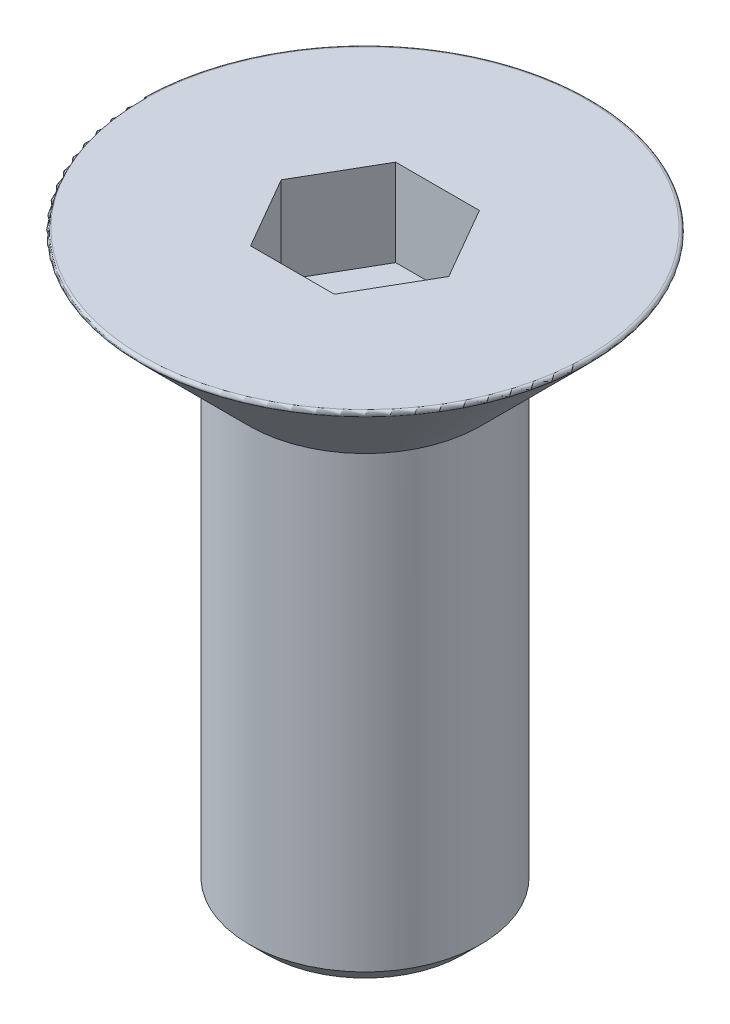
ISO-10303-21;
HEADER;
FILE_DESCRIPTION(('STEP AP214'),'2;1');
FILE_NAME('part.step','',(''),(''),'','','');
FILE_SCHEMA(('AUTOMOTIVE_DESIGN { 1 0 10303 214 1 1 1 1 }'));
ENDSEC;
DATA;
#1=APPLICATION_CONTEXT('core data for automotive mechanical design processes');
#2=APPLICATION_PROTOCOL_DEFINITION('international standard','automotive_design',2000,#1);
#3=PRODUCT_CONTEXT('',#1,'mechanical');
#4=PRODUCT('Part','Part','',(#3));
#5=PRODUCT_RELATED_PRODUCT_CATEGORY('part','',(#4));
#6=PRODUCT_DEFINITION_FORMATION('','',#4);
#7=PRODUCT_DEFINITION_CONTEXT('part definition',#1,'design');
#8=PRODUCT_DEFINITION('design','',#6,#7);
#9=PRODUCT_DEFINITION_SHAPE('','',#8);
#10=(LENGTH_UNIT() NAMED_UNIT(*) SI_UNIT(.MILLI.,.METRE.));
#11=(NAMED_UNIT(*) PLANE_ANGLE_UNIT() SI_UNIT($,.RADIAN.));
#12=(NAMED_UNIT(*) SI_UNIT($,.STERADIAN.) SOLID_ANGLE_UNIT());
#13=UNCERTAINTY_MEASURE_WITH_UNIT(LENGTH_MEASURE(1.E-05),#10,'distance_accuracy_value','');
#14=(GEOMETRIC_REPRESENTATION_CONTEXT(3) GLOBAL_UNCERTAINTY_ASSIGNED_CONTEXT((#13)) GLOBAL_UNIT_ASSIGNED_CONTEXT((#10,
#11,#12)) REPRESENTATION_CONTEXT('',''));
#15=CARTESIAN_POINT('',(0.,0.,0.));
#16=DIRECTION('',(0.,0.,1.));
#17=DIRECTION('',(1.,0.,0.));
#18=AXIS2_PLACEMENT_3D('',#15,#16,#17);
#19=CARTESIAN_POINT('',(0.,1.11022302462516E-13,0.));
#20=DIRECTION('',(0.,1.,0.));
#21=DIRECTION('',(0.,0.,1.));
#22=AXIS2_PLACEMENT_3D('',#19,#20,#21);
#23=PLANE('',#22);
#24=CARTESIAN_POINT('',(0.,1.11022302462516E-13,0.));
#25=DIRECTION('',(0.,1.,0.));
#26=DIRECTION('',(0.,0.,1.));
#27=AXIS2_PLACEMENT_3D('',#24,#25,#26);
#28=CIRCLE('',#27,7.65857864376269);
#29=CARTESIAN_POINT('',(0.,1.10892695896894E-13,7.65857864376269));
#30=VERTEX_POINT('',#29);
#31=EDGE_CURVE('E35',#30,#30,#28,.T.);
#32=ORIENTED_EDGE('',*,*,#31,.T.);
#33=EDGE_LOOP('',(#32));
#34=FACE_BOUND('',#33,.T.);
#35=DIRECTION('',(1.,0.,0.));
#36=VECTOR('',#35,1.);
#37=CARTESIAN_POINT('',(-1.44337567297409,-5.6843418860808E-11,2.5));
#38=LINE('',#37,#36);
#39=CARTESIAN_POINT('',(-1.44337567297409,-5.6843418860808E-11,2.5));
#40=VERTEX_POINT('',#39);
#41=CARTESIAN_POINT('',(1.44337567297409,1.11022302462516E-13,2.5));
#42=VERTEX_POINT('',#41);
#43=EDGE_CURVE('E42',#40,#42,#38,.T.);
#44=ORIENTED_EDGE('',*,*,#43,.F.);
#45=DIRECTION('',(-0.5,0.,-0.866025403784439));
#46=VECTOR('',#45,1.);
#47=CARTESIAN_POINT('',(-1.44337567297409,-5.6843418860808E-11,2.5));
#48=LINE('',#47,#46);
#49=CARTESIAN_POINT('',(-2.88675134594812,-5.67323965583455E-11,0.));
#50=VERTEX_POINT('',#49);
#51=EDGE_CURVE('E110',#40,#50,#48,.T.);
#52=ORIENTED_EDGE('',*,*,#51,.T.);
#53=DIRECTION('',(-0.499999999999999,0.,0.866025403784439));
#54=VECTOR('',#53,1.);
#55=CARTESIAN_POINT('',(-1.44337567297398,-5.6843418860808E-11,-2.5));
#56=LINE('',#55,#54);
#57=CARTESIAN_POINT('',(-1.44337567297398,-5.6843418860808E-11,-2.5));
#58=VERTEX_POINT('',#57);
#59=EDGE_CURVE('E104',#58,#50,#56,.T.);
#60=ORIENTED_EDGE('',*,*,#59,.F.);
#61=DIRECTION('',(1.,0.,0.));
#62=VECTOR('',#61,1.);
#63=CARTESIAN_POINT('',(-1.44337567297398,-5.6843418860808E-11,-2.5));
#64=LINE('',#63,#62);
#65=CARTESIAN_POINT('',(1.4433756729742,-5.67323965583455E-11,-2.5));
#66=VERTEX_POINT('',#65);
#67=EDGE_CURVE('E102',#58,#66,#64,.T.);
#68=ORIENTED_EDGE('',*,*,#67,.T.);
#69=DIRECTION('',(0.5,0.,0.866025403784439));
#70=VECTOR('',#69,1.);
#71=CARTESIAN_POINT('',(1.4433756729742,-5.67323965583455E-11,-2.5));
#72=LINE('',#71,#70);
#73=CARTESIAN_POINT('',(2.88675134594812,-5.6843418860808E-11,0.));
#74=VERTEX_POINT('',#73);
#75=EDGE_CURVE('E85',#66,#74,#72,.T.);
#76=ORIENTED_EDGE('',*,*,#75,.T.);
#77=DIRECTION('',(0.499999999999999,0.,-0.866025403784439));
#78=VECTOR('',#77,1.);
#79=CARTESIAN_POINT('',(1.44337567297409,-5.67323965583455E-11,2.5));
#80=LINE('',#79,#78);
#81=EDGE_CURVE('E96',#42,#74,#80,.T.);
#82=ORIENTED_EDGE('',*,*,#81,.F.);
#83=EDGE_LOOP('',(#44,#52,#60,#68,#76,#82));
#84=FACE_BOUND('',#83,.T.);
#85=ADVANCED_FACE('F28',(#34,#84),#23,.T.);
#86=CARTESIAN_POINT('',(0.,1.11022302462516E-13,0.));
#87=DIRECTION('',(0.,1.,0.));
#88=DIRECTION('',(0.,0.,1.));
#89=AXIS2_PLACEMENT_3D('',#86,#87,#88);
#90=CONICAL_SURFACE('',#89,7.9,0.78539816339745);
#91=CARTESIAN_POINT('',(0.,-0.17071067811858,0.));
#92=DIRECTION('',(0.,-1.,0.));
#93=DIRECTION('',(0.,0.,-1.));
#94=AXIS2_PLACEMENT_3D('',#91,#92,#93);
#95=CIRCLE('',#94,7.72928932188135);
#96=CARTESIAN_POINT('',(0.,-0.17071067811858,-7.72928932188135));
#97=VERTEX_POINT('',#96);
#98=EDGE_CURVE('E11',#97,#97,#95,.T.);
#99=ORIENTED_EDGE('',*,*,#98,.T.);
#100=EDGE_LOOP('',(#99));
#101=FACE_BOUND('',#100,.T.);
#102=CARTESIAN_POINT('',(0.,-3.8999999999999,0.));
#103=DIRECTION('',(0.,1.,0.));
#104=DIRECTION('',(0.,0.,1.));
#105=AXIS2_PLACEMENT_3D('',#102,#103,#104);
#106=CIRCLE('',#105,4.);
#107=CARTESIAN_POINT('',(0.,-3.8999999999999,4.));
#108=VERTEX_POINT('',#107);
#109=EDGE_CURVE('E127',#108,#108,#106,.T.);
#110=ORIENTED_EDGE('',*,*,#109,.T.);
#111=EDGE_LOOP('',(#110));
#112=FACE_BOUND('',#111,.T.);
#113=ADVANCED_FACE('F158',(#101,#112),#90,.T.);
#114=CARTESIAN_POINT('',(-1.11022302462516E-13,18.0202513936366,0.));
#115=DIRECTION('',(0.,1.,0.));
#116=DIRECTION('',(0.,0.,1.));
#117=AXIS2_PLACEMENT_3D('',#114,#115,#116);
#118=CYLINDRICAL_SURFACE('',#117,4.);
#119=CARTESIAN_POINT('',(0.,-19.3749999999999,0.));
#120=DIRECTION('',(0.,-1.,0.));
#121=DIRECTION('',(0.,0.,-1.));
#122=AXIS2_PLACEMENT_3D('',#119,#120,#121);
#123=CIRCLE('',#122,4.);
#124=CARTESIAN_POINT('',(0.,-19.3749999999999,-4.));
#125=VERTEX_POINT('',#124);
#126=EDGE_CURVE('E136',#125,#125,#123,.F.);
#127=ORIENTED_EDGE('',*,*,#126,.T.);
#128=EDGE_LOOP('',(#127));
#129=FACE_BOUND('',#128,.T.);
#130=ORIENTED_EDGE('',*,*,#109,.F.);
#131=EDGE_LOOP('',(#130));
#132=FACE_BOUND('',#131,.T.);
#133=ADVANCED_FACE('F162',(#129,#132),#118,.T.);
#134=CARTESIAN_POINT('',(3.99999999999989,-19.9999999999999,0.));
#135=DIRECTION('',(0.,-1.,0.));
#136=DIRECTION('',(0.,0.,-1.));
#137=AXIS2_PLACEMENT_3D('',#134,#135,#136);
#138=PLANE('',#137);
#139=CARTESIAN_POINT('',(-1.11022302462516E-13,-19.9999999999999,0.));
#140=DIRECTION('',(0.,-1.,0.));
#141=DIRECTION('',(0.,0.,-1.));
#142=AXIS2_PLACEMENT_3D('',#139,#140,#141);
#143=CIRCLE('',#142,3.37500000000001);
#144=CARTESIAN_POINT('',(-1.11553716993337E-13,-19.9999999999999,-3.37500000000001));
#145=VERTEX_POINT('',#144);
#146=EDGE_CURVE('E139',#145,#145,#143,.T.);
#147=ORIENTED_EDGE('',*,*,#146,.T.);
#148=EDGE_LOOP('',(#147));
#149=FACE_BOUND('',#148,.T.);
#150=ADVANCED_FACE('F167',(#149),#138,.T.);
#151=CARTESIAN_POINT('',(-1.44337567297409,-3.00000000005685,2.5));
#152=DIRECTION('',(0.,0.,1.));
#153=DIRECTION('',(1.,0.,0.));
#154=AXIS2_PLACEMENT_3D('',#151,#152,#153);
#155=PLANE('',#154);
#156=ORIENTED_EDGE('',*,*,#43,.T.);
#157=DIRECTION('',(0.,1.,0.));
#158=VECTOR('',#157,1.);
#159=CARTESIAN_POINT('',(1.44337567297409,-3.00000000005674,2.5));
#160=LINE('',#159,#158);
#161=CARTESIAN_POINT('',(1.44337567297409,-3.00000000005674,2.5));
#162=VERTEX_POINT('',#161);
#163=EDGE_CURVE('E93',#162,#42,#160,.T.);
#164=ORIENTED_EDGE('',*,*,#163,.F.);
#165=DIRECTION('',(1.,0.,0.));
#166=VECTOR('',#165,1.);
#167=CARTESIAN_POINT('',(-1.44337567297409,-3.00000000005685,2.5));
#168=LINE('',#167,#166);
#169=CARTESIAN_POINT('',(-1.44337567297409,-3.00000000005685,2.5));
#170=VERTEX_POINT('',#169);
#171=EDGE_CURVE('E113',#170,#162,#168,.T.);
#172=ORIENTED_EDGE('',*,*,#171,.F.);
#173=DIRECTION('',(0.,1.,0.));
#174=VECTOR('',#173,1.);
#175=CARTESIAN_POINT('',(-1.44337567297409,-3.00000000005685,2.5));
#176=LINE('',#175,#174);
#177=EDGE_CURVE('E49',#170,#40,#176,.T.);
#178=ORIENTED_EDGE('',*,*,#177,.T.);
#179=EDGE_LOOP('',(#156,#164,#172,#178));
#180=FACE_BOUND('',#179,.T.);
#181=ADVANCED_FACE('F174',(#180),#155,.F.);
#182=CARTESIAN_POINT('',(-1.44337567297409,-3.00000000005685,2.5));
#183=DIRECTION('',(0.866025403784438,0.,-0.5));
#184=DIRECTION('',(-0.5,0.,-0.866025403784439));
#185=AXIS2_PLACEMENT_3D('',#182,#183,#184);
#186=PLANE('',#185);
#187=ORIENTED_EDGE('',*,*,#51,.F.);
#188=ORIENTED_EDGE('',*,*,#177,.F.);
#189=DIRECTION('',(-0.5,0.,-0.866025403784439));
#190=VECTOR('',#189,1.);
#191=CARTESIAN_POINT('',(-1.44337567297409,-3.00000000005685,2.5));
#192=LINE('',#191,#190);
#193=CARTESIAN_POINT('',(-2.88675134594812,-3.00000000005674,0.));
#194=VERTEX_POINT('',#193);
#195=EDGE_CURVE('E124',#170,#194,#192,.T.);
#196=ORIENTED_EDGE('',*,*,#195,.T.);
#197=DIRECTION('',(0.,1.,0.));
#198=VECTOR('',#197,1.);
#199=CARTESIAN_POINT('',(-2.88675134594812,-3.00000000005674,0.));
#200=LINE('',#199,#198);
#201=EDGE_CURVE('E128',#194,#50,#200,.T.);
#202=ORIENTED_EDGE('',*,*,#201,.T.);
#203=EDGE_LOOP('',(#187,#188,#196,#202));
#204=FACE_BOUND('',#203,.T.);
#205=ADVANCED_FACE('F178',(#204),#186,.T.);
#206=CARTESIAN_POINT('',(-1.44337567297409,-3.00000000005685,-2.5));
#207=DIRECTION('',(-0.866025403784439,0.,-0.5));
#208=DIRECTION('',(-0.499999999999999,0.,0.866025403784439));
#209=AXIS2_PLACEMENT_3D('',#206,#207,#208);
#210=PLANE('',#209);
#211=ORIENTED_EDGE('',*,*,#59,.T.);
#212=ORIENTED_EDGE('',*,*,#201,.F.);
#213=DIRECTION('',(-0.499999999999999,0.,0.866025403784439));
#214=VECTOR('',#213,1.);
#215=CARTESIAN_POINT('',(-1.44337567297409,-3.00000000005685,-2.5));
#216=LINE('',#215,#214);
#217=CARTESIAN_POINT('',(-1.44337567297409,-3.00000000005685,-2.5));
#218=VERTEX_POINT('',#217);
#219=EDGE_CURVE('E121',#218,#194,#216,.T.);
#220=ORIENTED_EDGE('',*,*,#219,.F.);
#221=DIRECTION('',(0.,1.,0.));
#222=VECTOR('',#221,1.);
#223=CARTESIAN_POINT('',(-1.44337567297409,-3.00000000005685,-2.5));
#224=LINE('',#223,#222);
#225=EDGE_CURVE('E130',#218,#58,#224,.T.);
#226=ORIENTED_EDGE('',*,*,#225,.T.);
#227=EDGE_LOOP('',(#211,#212,#220,#226));
#228=FACE_BOUND('',#227,.T.);
#229=ADVANCED_FACE('F186',(#228),#210,.F.);
#230=CARTESIAN_POINT('',(-1.44337567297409,-3.00000000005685,-2.5));
#231=DIRECTION('',(0.,0.,1.));
#232=DIRECTION('',(1.,0.,0.));
#233=AXIS2_PLACEMENT_3D('',#230,#231,#232);
#234=PLANE('',#233);
#235=ORIENTED_EDGE('',*,*,#67,.F.);
#236=ORIENTED_EDGE('',*,*,#225,.F.);
#237=DIRECTION('',(1.,0.,0.));
#238=VECTOR('',#237,1.);
#239=CARTESIAN_POINT('',(-1.44337567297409,-3.00000000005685,-2.5));
#240=LINE('',#239,#238);
#241=CARTESIAN_POINT('',(1.44337567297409,-3.00000000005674,-2.5));
#242=VERTEX_POINT('',#241);
#243=EDGE_CURVE('E119',#218,#242,#240,.T.);
#244=ORIENTED_EDGE('',*,*,#243,.T.);
#245=DIRECTION('',(0.,1.,0.));
#246=VECTOR('',#245,1.);
#247=CARTESIAN_POINT('',(1.44337567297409,-3.00000000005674,-2.5));
#248=LINE('',#247,#246);
#249=EDGE_CURVE('E92',#242,#66,#248,.T.);
#250=ORIENTED_EDGE('',*,*,#249,.T.);
#251=EDGE_LOOP('',(#235,#236,#244,#250));
#252=FACE_BOUND('',#251,.T.);
#253=ADVANCED_FACE('F183',(#252),#234,.T.);
#254=CARTESIAN_POINT('',(1.44337567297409,-3.00000000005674,-2.5));
#255=DIRECTION('',(-0.866025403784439,0.,0.5));
#256=DIRECTION('',(0.5,0.,0.866025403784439));
#257=AXIS2_PLACEMENT_3D('',#254,#255,#256);
#258=PLANE('',#257);
#259=ORIENTED_EDGE('',*,*,#75,.F.);
#260=ORIENTED_EDGE('',*,*,#249,.F.);
#261=DIRECTION('',(0.5,0.,0.866025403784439));
#262=VECTOR('',#261,1.);
#263=CARTESIAN_POINT('',(1.44337567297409,-3.00000000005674,-2.5));
#264=LINE('',#263,#262);
#265=CARTESIAN_POINT('',(2.88675134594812,-3.00000000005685,0.));
#266=VERTEX_POINT('',#265);
#267=EDGE_CURVE('E88',#242,#266,#264,.T.);
#268=ORIENTED_EDGE('',*,*,#267,.T.);
#269=DIRECTION('',(0.,1.,0.));
#270=VECTOR('',#269,1.);
#271=CARTESIAN_POINT('',(2.88675134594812,-3.00000000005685,0.));
#272=LINE('',#271,#270);
#273=EDGE_CURVE('E80',#266,#74,#272,.T.);
#274=ORIENTED_EDGE('',*,*,#273,.T.);
#275=EDGE_LOOP('',(#259,#260,#268,#274));
#276=FACE_BOUND('',#275,.T.);
#277=ADVANCED_FACE('F82',(#276),#258,.T.);
#278=CARTESIAN_POINT('',(1.44337567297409,-3.00000000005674,2.5));
#279=DIRECTION('',(0.866025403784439,0.,0.5));
#280=DIRECTION('',(0.5,0.,-0.866025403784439));
#281=AXIS2_PLACEMENT_3D('',#278,#279,#280);
#282=PLANE('',#281);
#283=ORIENTED_EDGE('',*,*,#81,.T.);
#284=ORIENTED_EDGE('',*,*,#273,.F.);
#285=DIRECTION('',(0.499999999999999,0.,-0.866025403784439));
#286=VECTOR('',#285,1.);
#287=CARTESIAN_POINT('',(1.44337567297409,-3.00000000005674,2.5));
#288=LINE('',#287,#286);
#289=EDGE_CURVE('E116',#162,#266,#288,.T.);
#290=ORIENTED_EDGE('',*,*,#289,.F.);
#291=ORIENTED_EDGE('',*,*,#163,.T.);
#292=EDGE_LOOP('',(#283,#284,#290,#291));
#293=FACE_BOUND('',#292,.T.);
#294=ADVANCED_FACE('F97',(#293),#282,.F.);
#295=CARTESIAN_POINT('',(-4.33012701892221,-3.00000000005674,2.5));
#296=DIRECTION('',(0.,-1.,0.));
#297=DIRECTION('',(0.,0.,-1.));
#298=AXIS2_PLACEMENT_3D('',#295,#296,#297);
#299=PLANE('',#298);
#300=ORIENTED_EDGE('',*,*,#171,.T.);
#301=ORIENTED_EDGE('',*,*,#289,.T.);
#302=ORIENTED_EDGE('',*,*,#267,.F.);
#303=ORIENTED_EDGE('',*,*,#243,.F.);
#304=ORIENTED_EDGE('',*,*,#219,.T.);
#305=ORIENTED_EDGE('',*,*,#195,.F.);
#306=EDGE_LOOP('',(#300,#301,#302,#303,#304,#305));
#307=FACE_BOUND('',#306,.T.);
#308=ADVANCED_FACE('F153',(#307),#299,.F.);
#309=CARTESIAN_POINT('',(0.,-19.3749999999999,0.));
#310=DIRECTION('',(0.,1.,0.));
#311=DIRECTION('',(0.,0.,1.));
#312=AXIS2_PLACEMENT_3D('',#309,#310,#311);
#313=CONICAL_SURFACE('',#312,4.,0.785398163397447);
#314=ORIENTED_EDGE('',*,*,#146,.F.);
#315=EDGE_LOOP('',(#314));
#316=FACE_BOUND('',#315,.T.);
#317=ORIENTED_EDGE('',*,*,#126,.F.);
#318=EDGE_LOOP('',(#317));
#319=FACE_BOUND('',#318,.T.);
#320=ADVANCED_FACE('F147',(#316,#319),#313,.T.);
#321=CARTESIAN_POINT('',(0.,-0.099999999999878,0.));
#322=DIRECTION('',(0.,1.,0.));
#323=DIRECTION('',(0.,0.,1.));
#324=AXIS2_PLACEMENT_3D('',#321,#322,#323);
#325=TOROIDAL_SURFACE('',#324,7.65857864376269,0.1);
#326=ORIENTED_EDGE('',*,*,#98,.F.);
#327=EDGE_LOOP('',(#326));
#328=FACE_BOUND('',#327,.T.);
#329=ORIENTED_EDGE('',*,*,#31,.F.);
#330=EDGE_LOOP('',(#329));
#331=FACE_BOUND('',#330,.T.);
#332=ADVANCED_FACE('F145',(#328,#331),#325,.T.);
#333=CLOSED_SHELL('',(#85,#113,#133,#150,#181,#205,#229,#253,#277,#294,#308,#320,#332));
#334=MANIFOLD_SOLID_BREP('B2',#333);
#335=ADVANCED_BREP_SHAPE_REPRESENTATION('',(#18,#334),#14);
#336=SHAPE_DEFINITION_REPRESENTATION(#9,#335);
ENDSEC;
END-ISO-10303-21;
